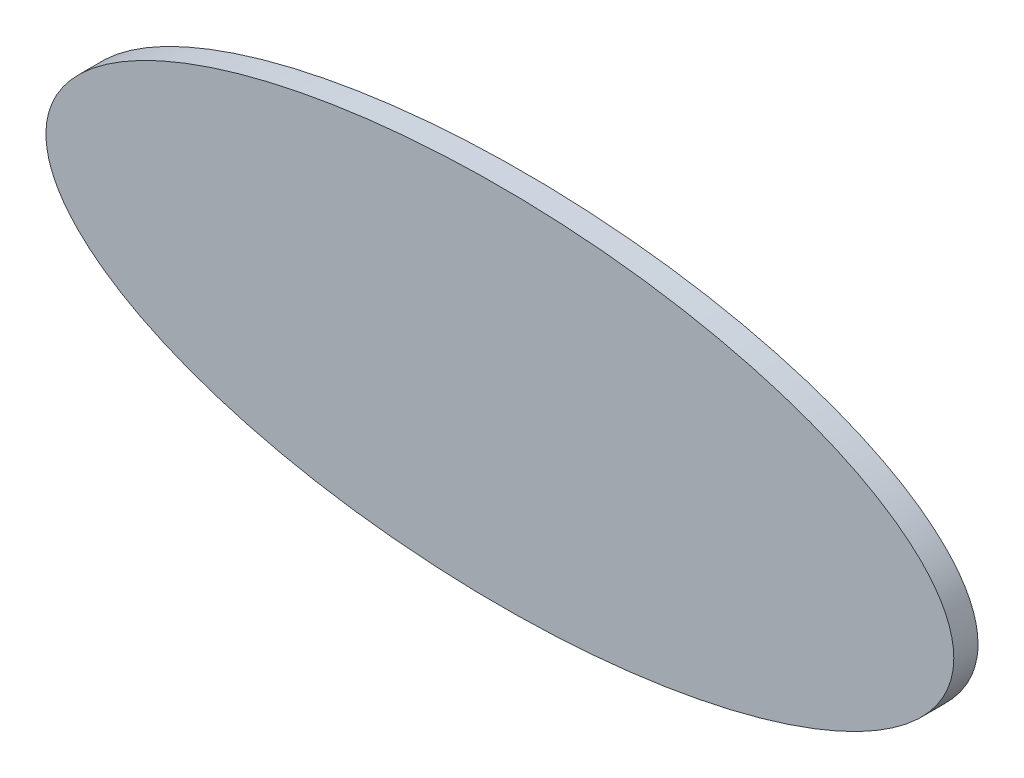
from build123d import *

# Parameters (mm, degrees)
SKETCH1_RX     = 37.5
SKETCH1_RY     = 15
EXTRUDE1_DEPTH = 2


with BuildPart() as part:
    # Sketch1 → Extrude1 (new body)
    with BuildSketch(Plane.XY):
        with Locations((0, 0)):
            Ellipse(SKETCH1_RX, SKETCH1_RY)
    extrude(amount=EXTRUDE1_DEPTH)


solid = part.part
